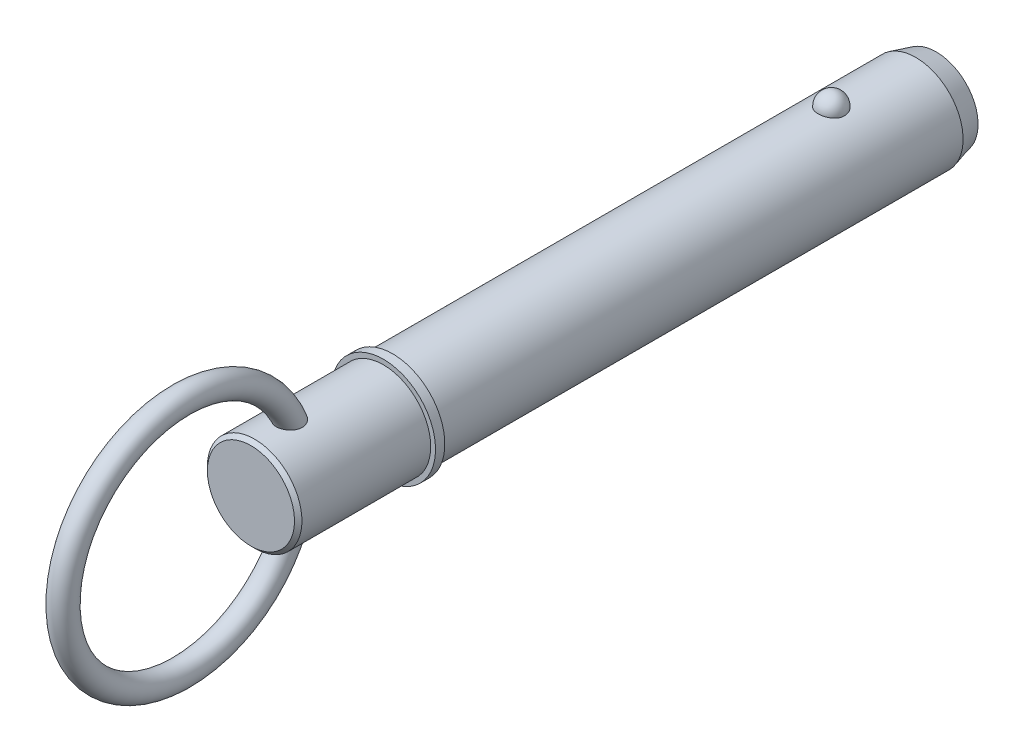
ISO-10303-21;
HEADER;
FILE_DESCRIPTION(('STEP AP214'),'2;1');
FILE_NAME('part.step','',(''),(''),'','','');
FILE_SCHEMA(('AUTOMOTIVE_DESIGN { 1 0 10303 214 1 1 1 1 }'));
ENDSEC;
DATA;
#1=APPLICATION_CONTEXT('core data for automotive mechanical design processes');
#2=APPLICATION_PROTOCOL_DEFINITION('international standard','automotive_design',2000,#1);
#3=PRODUCT_CONTEXT('',#1,'mechanical');
#4=PRODUCT('Part','Part','',(#3));
#5=PRODUCT_RELATED_PRODUCT_CATEGORY('part','',(#4));
#6=PRODUCT_DEFINITION_FORMATION('','',#4);
#7=PRODUCT_DEFINITION_CONTEXT('part definition',#1,'design');
#8=PRODUCT_DEFINITION('design','',#6,#7);
#9=PRODUCT_DEFINITION_SHAPE('','',#8);
#10=(LENGTH_UNIT() NAMED_UNIT(*) SI_UNIT(.MILLI.,.METRE.));
#11=(NAMED_UNIT(*) PLANE_ANGLE_UNIT() SI_UNIT($,.RADIAN.));
#12=(NAMED_UNIT(*) SI_UNIT($,.STERADIAN.) SOLID_ANGLE_UNIT());
#13=UNCERTAINTY_MEASURE_WITH_UNIT(LENGTH_MEASURE(1.E-05),#10,'distance_accuracy_value','');
#14=(GEOMETRIC_REPRESENTATION_CONTEXT(3) GLOBAL_UNCERTAINTY_ASSIGNED_CONTEXT((#13)) GLOBAL_UNIT_ASSIGNED_CONTEXT((#10,
#11,#12)) REPRESENTATION_CONTEXT('',''));
#15=CARTESIAN_POINT('',(0.,0.,0.));
#16=DIRECTION('',(0.,0.,1.));
#17=DIRECTION('',(1.,0.,0.));
#18=AXIS2_PLACEMENT_3D('',#15,#16,#17);
#19=CARTESIAN_POINT('',(0.,0.,114.3));
#20=DIRECTION('',(0.,0.,-1.));
#21=DIRECTION('',(-1.,0.,0.));
#22=AXIS2_PLACEMENT_3D('',#19,#20,#21);
#23=CYLINDRICAL_SURFACE('',#22,12.7);
#24=CARTESIAN_POINT('',(3.52486003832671,12.2010393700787,-3.56));
#25=CARTESIAN_POINT('',(3.52485671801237,12.2010422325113,-3.3610062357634));
#26=CARTESIAN_POINT('',(3.50863187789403,12.2057632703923,-3.16197042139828));
#27=CARTESIAN_POINT('',(3.4441205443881,12.2241207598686,-2.76953945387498));
#28=CARTESIAN_POINT('',(3.39582213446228,12.2377605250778,-2.57614642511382));
#29=CARTESIAN_POINT('',(3.26839193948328,12.2724057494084,-2.20059799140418));
#30=CARTESIAN_POINT('',(3.18927369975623,12.2934079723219,-2.01843769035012));
#31=CARTESIAN_POINT('',(3.00217139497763,12.3404306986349,-1.6703228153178));
#32=CARTESIAN_POINT('',(2.89418796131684,12.3664510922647,-1.50436788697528));
#33=CARTESIAN_POINT('',(2.65144862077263,12.4207616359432,-1.19241975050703));
#34=CARTESIAN_POINT('',(2.51656310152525,12.4490623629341,-1.04652919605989));
#35=CARTESIAN_POINT('',(2.22383249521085,12.5046678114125,-0.779711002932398));
#36=CARTESIAN_POINT('',(2.0659873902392,12.5319725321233,-0.658783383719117));
#37=CARTESIAN_POINT('',(1.73204520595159,12.5824645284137,-0.445586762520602));
#38=CARTESIAN_POINT('',(1.55600183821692,12.6056634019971,-0.353236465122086));
#39=CARTESIAN_POINT('',(1.19021695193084,12.6454411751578,-0.199381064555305));
#40=CARTESIAN_POINT('',(1.00047694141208,12.6620208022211,-0.137872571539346));
#41=CARTESIAN_POINT('',(0.616329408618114,12.6864692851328,-0.0483191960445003));
#42=CARTESIAN_POINT('',(0.422067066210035,12.6944893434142,-0.0196927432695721));
#43=CARTESIAN_POINT('',(0.0313259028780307,12.7014637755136,0.00524116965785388));
#44=CARTESIAN_POINT('',(-0.165152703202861,12.7004190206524,0.00155173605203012));
#45=CARTESIAN_POINT('',(-0.551780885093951,12.6894611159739,-0.0377454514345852));
#46=CARTESIAN_POINT('',(-0.74198078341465,12.6796749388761,-0.0728962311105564));
#47=CARTESIAN_POINT('',(-1.11361063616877,12.6524544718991,-0.173489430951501));
#48=CARTESIAN_POINT('',(-1.29504043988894,12.6350200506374,-0.238932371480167));
#49=CARTESIAN_POINT('',(-1.64521311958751,12.5942270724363,-0.398772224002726));
#50=CARTESIAN_POINT('',(-1.81387645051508,12.5708347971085,-0.493334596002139));
#51=CARTESIAN_POINT('',(-2.13292959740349,12.5206522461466,-0.708731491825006));
#52=CARTESIAN_POINT('',(-2.28331755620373,12.4938616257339,-0.829568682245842));
#53=CARTESIAN_POINT('',(-2.56470285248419,12.4391828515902,-1.0968714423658));
#54=CARTESIAN_POINT('',(-2.69527522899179,12.4112835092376,-1.24378221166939));
#55=CARTESIAN_POINT('',(-2.93023079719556,12.3579248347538,-1.55763192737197));
#56=CARTESIAN_POINT('',(-3.03461212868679,12.3324656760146,-1.72457229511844));
#57=CARTESIAN_POINT('',(-3.21564423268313,12.2865167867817,-2.07598316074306));
#58=CARTESIAN_POINT('',(-3.29196222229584,12.2660875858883,-2.26063321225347));
#59=CARTESIAN_POINT('',(-3.41323771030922,12.2328979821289,-2.64061334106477));
#60=CARTESIAN_POINT('',(-3.45819611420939,12.2201373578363,-2.83594310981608));
#61=CARTESIAN_POINT('',(-3.51550038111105,12.2037762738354,-3.2308649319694));
#62=CARTESIAN_POINT('',(-3.5279827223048,12.200137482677,-3.43043558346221));
#63=CARTESIAN_POINT('',(-3.52041430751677,12.2023234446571,-3.8289025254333));
#64=CARTESIAN_POINT('',(-3.50036443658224,12.2081479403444,-4.02779883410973));
#65=CARTESIAN_POINT('',(-3.42842010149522,12.2285446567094,-4.41824213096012));
#66=CARTESIAN_POINT('',(-3.37668525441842,12.243073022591,-4.6098208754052));
#67=CARTESIAN_POINT('',(-3.24279085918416,12.2792134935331,-4.98132360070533));
#68=CARTESIAN_POINT('',(-3.16063009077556,12.300825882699,-5.16124711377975));
#69=CARTESIAN_POINT('',(-2.96738224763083,12.3488691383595,-5.50542856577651));
#70=CARTESIAN_POINT('',(-2.85613997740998,12.3753256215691,-5.66959579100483));
#71=CARTESIAN_POINT('',(-2.60773241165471,12.4300386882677,-5.97665065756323));
#72=CARTESIAN_POINT('',(-2.47056612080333,12.458295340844,-6.11953748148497));
#73=CARTESIAN_POINT('',(-2.17327999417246,12.5135827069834,-6.38059312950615));
#74=CARTESIAN_POINT('',(-2.01307652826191,12.5406084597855,-6.49866785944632));
#75=CARTESIAN_POINT('',(-1.67442544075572,12.5902954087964,-6.70609314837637));
#76=CARTESIAN_POINT('',(-1.49597909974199,12.6129569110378,-6.79544572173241));
#77=CARTESIAN_POINT('',(-1.12819666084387,12.6511224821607,-6.94192787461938));
#78=CARTESIAN_POINT('',(-0.93902400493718,12.666712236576,-6.99944518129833));
#79=CARTESIAN_POINT('',(-0.553267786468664,12.6894125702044,-7.08227444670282));
#80=CARTESIAN_POINT('',(-0.356685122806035,12.6965241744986,-7.10759029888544));
#81=CARTESIAN_POINT('',(0.0343320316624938,12.7014305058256,-7.12510946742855));
#82=CARTESIAN_POINT('',(0.228736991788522,12.6993986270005,-7.11792901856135));
#83=CARTESIAN_POINT('',(0.613493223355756,12.6866339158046,-7.07206766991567));
#84=CARTESIAN_POINT('',(0.803844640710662,12.6759013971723,-7.03338790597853));
#85=CARTESIAN_POINT('',(1.17440741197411,12.6469443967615,-6.925834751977));
#86=CARTESIAN_POINT('',(1.35465462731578,12.6287486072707,-6.85707692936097));
#87=CARTESIAN_POINT('',(1.70092526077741,12.5867908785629,-6.69128257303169));
#88=CARTESIAN_POINT('',(1.86694777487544,12.5630285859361,-6.59424424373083));
#89=CARTESIAN_POINT('',(2.18289085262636,12.5120350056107,-6.3727748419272));
#90=CARTESIAN_POINT('',(2.33252391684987,12.4847559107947,-6.24794475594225));
#91=CARTESIAN_POINT('',(2.60889724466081,12.4299457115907,-5.97511730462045));
#92=CARTESIAN_POINT('',(2.73563353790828,12.4024145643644,-5.82711592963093));
#93=CARTESIAN_POINT('',(2.96505559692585,12.3495984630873,-5.5091226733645));
#94=CARTESIAN_POINT('',(3.06728335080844,12.3243610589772,-5.33879227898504));
#95=CARTESIAN_POINT('',(3.24218794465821,12.2795120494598,-4.98295005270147));
#96=CARTESIAN_POINT('',(3.31487538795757,12.2598984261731,-4.79744369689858));
#97=CARTESIAN_POINT('',(3.42255689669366,12.2302435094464,-4.43775244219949));
#98=CARTESIAN_POINT('',(3.46085292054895,12.2193780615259,-4.264615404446));
#99=CARTESIAN_POINT('',(3.5120056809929,12.2047747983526,-3.9143299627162));
#100=CARTESIAN_POINT('',(3.52486299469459,12.2010368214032,-3.73718164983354));
#101=CARTESIAN_POINT('',(3.52486003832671,12.2010393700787,-3.56));
#102=B_SPLINE_CURVE_WITH_KNOTS('',3,(#24,#25,#26,#27,#28,#29,#30,#31,#32,#33,#34,#35,#36,#37,
#38,#39,#40,#41,#42,#43,#44,#45,#46,#47,#48,#49,#50,#51,#52,#53,#54,#55,#56,#57,#58,#59,#60,#61,
#62,#63,#64,#65,#66,#67,#68,#69,#70,#71,#72,#73,#74,#75,#76,#77,#78,#79,#80,#81,#82,#83,#84,#85,
#86,#87,#88,#89,#90,#91,#92,#93,#94,#95,#96,#97,#98,#99,#100,#101),.UNSPECIFIED.,.T.,.F.,(4,2,2,
2,2,2,2,2,2,2,2,2,2,2,2,2,2,2,2,2,2,2,2,2,2,2,2,2,2,2,2,2,2,2,2,2,2,2,4),(0.,0.596344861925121,
1.19291141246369,1.78921606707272,2.38550767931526,2.98474477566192,3.58398233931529,
4.18149920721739,4.77895038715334,5.36566361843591,5.95232045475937,6.53059198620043,
7.10887345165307,7.6905033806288,8.27219236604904,8.86498552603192,9.45782077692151,
10.0574751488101,10.6571122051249,11.2542252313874,11.8513220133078,12.4454353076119,
13.0395724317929,13.636947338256,14.2343451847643,14.8339691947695,15.4335511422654,
16.0256602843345,16.6176978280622,17.1985559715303,17.7793931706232,18.3580179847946,
18.9366795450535,19.5242567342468,20.1119357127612,20.7098642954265,21.3075780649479,
21.8385683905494,22.3695466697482),.UNSPECIFIED.);
#103=CARTESIAN_POINT('',(3.52486003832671,12.2010393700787,-3.56));
#104=VERTEX_POINT('',#103);
#105=EDGE_CURVE('E101',#104,#104,#102,.T.);
#106=ORIENTED_EDGE('',*,*,#105,.T.);
#107=EDGE_LOOP('',(#106));
#108=FACE_BOUND('',#107,.T.);
#109=CARTESIAN_POINT('',(0.,0.,-26.2499999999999));
#110=DIRECTION('',(0.,0.,-1.));
#111=DIRECTION('',(-1.,0.,0.));
#112=AXIS2_PLACEMENT_3D('',#109,#110,#111);
#113=CIRCLE('',#112,12.7);
#114=CARTESIAN_POINT('',(-12.7,0.,-26.2499999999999));
#115=VERTEX_POINT('',#114);
#116=EDGE_CURVE('E109',#115,#115,#113,.F.);
#117=ORIENTED_EDGE('',*,*,#116,.T.);
#118=EDGE_LOOP('',(#117));
#119=FACE_BOUND('',#118,.T.);
#120=CARTESIAN_POINT('',(0.,0.,114.3));
#121=DIRECTION('',(0.,0.,1.));
#122=DIRECTION('',(1.,0.,0.));
#123=AXIS2_PLACEMENT_3D('',#120,#121,#122);
#124=CIRCLE('',#123,12.7);
#125=CARTESIAN_POINT('',(12.7,0.,114.3));
#126=VERTEX_POINT('',#125);
#127=EDGE_CURVE('E107',#126,#126,#124,.T.);
#128=ORIENTED_EDGE('',*,*,#127,.F.);
#129=EDGE_LOOP('',(#128));
#130=FACE_BOUND('',#129,.T.);
#131=ADVANCED_FACE('F39',(#108,#119,#130),#23,.T.);
#132=CARTESIAN_POINT('',(0.,0.,-31.75));
#133=DIRECTION('',(0.,0.,-1.));
#134=DIRECTION('',(-1.,0.,0.));
#135=AXIS2_PLACEMENT_3D('',#132,#133,#134);
#136=PLANE('',#135);
#137=CARTESIAN_POINT('',(0.,0.,-31.75));
#138=DIRECTION('',(0.,0.,-1.));
#139=DIRECTION('',(-1.,0.,0.));
#140=AXIS2_PLACEMENT_3D('',#137,#138,#139);
#141=CIRCLE('',#140,11.2262794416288);
#142=CARTESIAN_POINT('',(-11.2262794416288,0.,-31.75));
#143=VERTEX_POINT('',#142);
#144=EDGE_CURVE('E142',#143,#143,#141,.T.);
#145=ORIENTED_EDGE('',*,*,#144,.T.);
#146=EDGE_LOOP('',(#145));
#147=FACE_BOUND('',#146,.T.);
#148=ADVANCED_FACE('F87',(#147),#136,.T.);
#149=CARTESIAN_POINT('',(0.,0.,-31.75));
#150=DIRECTION('',(0.,0.,1.));
#151=DIRECTION('',(1.,0.,0.));
#152=AXIS2_PLACEMENT_3D('',#149,#150,#151);
#153=CONICAL_SURFACE('',#152,11.2262794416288,0.261799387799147);
#154=ORIENTED_EDGE('',*,*,#116,.F.);
#155=EDGE_LOOP('',(#154));
#156=FACE_BOUND('',#155,.T.);
#157=ORIENTED_EDGE('',*,*,#144,.F.);
#158=EDGE_LOOP('',(#157));
#159=FACE_BOUND('',#158,.T.);
#160=ADVANCED_FACE('F93',(#156,#159),#153,.T.);
#161=CARTESIAN_POINT('',(0.,12.7,-3.56));
#162=DIRECTION('',(0.,1.,0.));
#163=DIRECTION('',(0.,0.,1.));
#164=AXIS2_PLACEMENT_3D('',#161,#162,#163);
#165=SPHERICAL_SURFACE('',#164,3.56);
#166=ORIENTED_EDGE('',*,*,#105,.F.);
#167=EDGE_LOOP('',(#166));
#168=FACE_BOUND('',#167,.T.);
#169=ADVANCED_FACE('F112',(#168),#165,.T.);
#170=CARTESIAN_POINT('',(0.,0.,114.3));
#171=DIRECTION('',(0.,0.,-1.));
#172=DIRECTION('',(-1.,0.,0.));
#173=AXIS2_PLACEMENT_3D('',#170,#171,#172);
#174=PLANE('',#173);
#175=ORIENTED_EDGE('',*,*,#127,.T.);
#176=EDGE_LOOP('',(#175));
#177=FACE_BOUND('',#176,.T.);
#178=CARTESIAN_POINT('',(0.,0.,114.3));
#179=DIRECTION('',(0.,0.,-1.));
#180=DIRECTION('',(-1.,0.,0.));
#181=AXIS2_PLACEMENT_3D('',#178,#179,#180);
#182=CIRCLE('',#181,14.);
#183=CARTESIAN_POINT('',(-14.,0.,114.3));
#184=VERTEX_POINT('',#183);
#185=EDGE_CURVE('E108',#184,#184,#182,.T.);
#186=ORIENTED_EDGE('',*,*,#185,.T.);
#187=EDGE_LOOP('',(#186));
#188=FACE_BOUND('',#187,.T.);
#189=ADVANCED_FACE('F116',(#177,#188),#174,.T.);
#190=CARTESIAN_POINT('',(0.,0.,33.7287874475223));
#191=DIRECTION('',(0.,0.,-1.));
#192=DIRECTION('',(-1.,0.,0.));
#193=AXIS2_PLACEMENT_3D('',#190,#191,#192);
#194=CYLINDRICAL_SURFACE('',#193,14.);
#195=CARTESIAN_POINT('',(0.,0.,116.8));
#196=DIRECTION('',(0.,0.,-1.));
#197=DIRECTION('',(-1.,0.,0.));
#198=AXIS2_PLACEMENT_3D('',#195,#196,#197);
#199=CIRCLE('',#198,14.);
#200=CARTESIAN_POINT('',(-14.,0.,116.8));
#201=VERTEX_POINT('',#200);
#202=EDGE_CURVE('E133',#201,#201,#199,.T.);
#203=ORIENTED_EDGE('',*,*,#202,.T.);
#204=EDGE_LOOP('',(#203));
#205=FACE_BOUND('',#204,.T.);
#206=ORIENTED_EDGE('',*,*,#185,.F.);
#207=EDGE_LOOP('',(#206));
#208=FACE_BOUND('',#207,.T.);
#209=ADVANCED_FACE('F120',(#205,#208),#194,.T.);
#210=CARTESIAN_POINT('',(0.,14.,116.8));
#211=DIRECTION('',(0.,0.,1.));
#212=DIRECTION('',(1.,0.,0.));
#213=AXIS2_PLACEMENT_3D('',#210,#211,#212);
#214=PLANE('',#213);
#215=CARTESIAN_POINT('',(0.,0.,116.8));
#216=DIRECTION('',(0.,0.,1.));
#217=DIRECTION('',(1.,0.,0.));
#218=AXIS2_PLACEMENT_3D('',#215,#216,#217);
#219=CIRCLE('',#218,12.7);
#220=CARTESIAN_POINT('',(12.7,0.,116.8));
#221=VERTEX_POINT('',#220);
#222=EDGE_CURVE('E111',#221,#221,#219,.T.);
#223=ORIENTED_EDGE('',*,*,#222,.F.);
#224=EDGE_LOOP('',(#223));
#225=FACE_BOUND('',#224,.T.);
#226=ORIENTED_EDGE('',*,*,#202,.F.);
#227=EDGE_LOOP('',(#226));
#228=FACE_BOUND('',#227,.T.);
#229=ADVANCED_FACE('F84',(#225,#228),#214,.T.);
#230=CARTESIAN_POINT('',(0.,0.,152.4));
#231=DIRECTION('',(0.,0.,-1.));
#232=DIRECTION('',(-1.,0.,0.));
#233=AXIS2_PLACEMENT_3D('',#230,#231,#232);
#234=CYLINDRICAL_SURFACE('',#233,12.7);
#235=CARTESIAN_POINT('',(-1.22892607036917,-12.6404011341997,138.77119395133));
#236=CARTESIAN_POINT('',(-1.06119922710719,-12.6567092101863,138.704004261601));
#237=CARTESIAN_POINT('',(-0.887663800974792,-12.6701810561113,138.650792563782));
#238=CARTESIAN_POINT('',(-0.533823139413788,-12.6900116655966,138.573419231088));
#239=CARTESIAN_POINT('',(-0.353518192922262,-12.6963707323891,138.5492563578));
#240=CARTESIAN_POINT('',(0.00871153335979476,-12.7012887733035,138.530519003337));
#241=CARTESIAN_POINT('',(0.190636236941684,-12.699848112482,138.535943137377));
#242=CARTESIAN_POINT('',(0.550971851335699,-12.6893231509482,138.576255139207));
#243=CARTESIAN_POINT('',(0.729382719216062,-12.6802387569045,138.61114336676));
#244=CARTESIAN_POINT('',(1.0777168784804,-12.6553960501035,138.709659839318));
#245=CARTESIAN_POINT('',(1.24763507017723,-12.6396337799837,138.773305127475));
#246=CARTESIAN_POINT('',(1.57398922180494,-12.6031560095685,138.927891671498));
#247=CARTESIAN_POINT('',(1.73042571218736,-12.5824407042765,139.018831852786));
#248=CARTESIAN_POINT('',(2.02464767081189,-12.5384554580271,139.225320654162));
#249=CARTESIAN_POINT('',(2.16251370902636,-12.5151974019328,139.34075697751));
#250=CARTESIAN_POINT('',(2.41652917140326,-12.4686447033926,139.593426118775));
#251=CARTESIAN_POINT('',(2.53268123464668,-12.4453500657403,139.730656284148));
#252=CARTESIAN_POINT('',(2.7397169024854,-12.4014166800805,140.02226178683));
#253=CARTESIAN_POINT('',(2.83072997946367,-12.3807646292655,140.176543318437));
#254=CARTESIAN_POINT('',(2.98642630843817,-12.3441356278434,140.498338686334));
#255=CARTESIAN_POINT('',(3.05110876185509,-12.3281588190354,140.665852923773));
#256=CARTESIAN_POINT('',(3.15450336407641,-12.3021148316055,141.012705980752));
#257=CARTESIAN_POINT('',(3.19268116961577,-12.2921697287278,141.192212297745));
#258=CARTESIAN_POINT('',(3.24150148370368,-12.2793848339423,141.555144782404));
#259=CARTESIAN_POINT('',(3.25213515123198,-12.2765473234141,141.738572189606));
#260=CARTESIAN_POINT('',(3.24696781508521,-12.2779158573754,142.118893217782));
#261=CARTESIAN_POINT('',(3.22910261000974,-12.2826719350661,142.315753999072));
#262=CARTESIAN_POINT('',(3.1650495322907,-12.2993299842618,142.70447917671));
#263=CARTESIAN_POINT('',(3.11884966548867,-12.3112349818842,142.896341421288));
#264=CARTESIAN_POINT('',(2.99323123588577,-12.3424162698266,143.292891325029));
#265=CARTESIAN_POINT('',(2.91059577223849,-12.3623844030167,143.496505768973));
#266=CARTESIAN_POINT('',(2.71447440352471,-12.4069229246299,143.888190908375));
#267=CARTESIAN_POINT('',(2.60094970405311,-12.431499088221,144.076241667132));
#268=CARTESIAN_POINT('',(2.40499526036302,-12.4703951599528,144.347470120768));
#269=CARTESIAN_POINT('',(2.33301847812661,-12.4841083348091,144.438407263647));
#270=CARTESIAN_POINT('',(2.18106597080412,-12.5115521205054,144.613320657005));
#271=CARTESIAN_POINT('',(2.10108885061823,-12.5252827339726,144.697295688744));
#272=CARTESIAN_POINT('',(1.84973962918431,-12.5657115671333,144.936779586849));
#273=CARTESIAN_POINT('',(1.6664677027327,-12.5917488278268,145.080526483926));
#274=CARTESIAN_POINT('',(1.33551340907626,-12.6303067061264,145.285856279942));
#275=CARTESIAN_POINT('',(1.19512135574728,-12.6444898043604,145.35902243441));
#276=CARTESIAN_POINT('',(0.903945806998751,-12.6686276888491,145.481586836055));
#277=CARTESIAN_POINT('',(0.753173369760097,-12.6785868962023,145.531009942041));
#278=CARTESIAN_POINT('',(0.444090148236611,-12.6931800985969,145.602942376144));
#279=CARTESIAN_POINT('',(0.285741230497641,-12.6977833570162,145.625296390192));
#280=CARTESIAN_POINT('',(-0.0324491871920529,-12.700953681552,145.640724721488));
#281=CARTESIAN_POINT('',(-0.192290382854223,-12.6995219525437,145.633804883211));
#282=CARTESIAN_POINT('',(-0.493822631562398,-12.6912132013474,145.593209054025));
#283=CARTESIAN_POINT('',(-0.635865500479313,-12.6848307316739,145.561962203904));
#284=CARTESIAN_POINT('',(-0.913041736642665,-12.6678986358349,145.477721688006));
#285=CARTESIAN_POINT('',(-1.04817349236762,-12.6573480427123,145.424722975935));
#286=CARTESIAN_POINT('',(-1.31637898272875,-12.6323524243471,145.296233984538));
#287=CARTESIAN_POINT('',(-1.44890088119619,-12.6177203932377,145.219638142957));
#288=CARTESIAN_POINT('',(-1.70162176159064,-12.5861326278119,145.048743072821));
#289=CARTESIAN_POINT('',(-1.82181486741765,-12.569175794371,144.954435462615));
#290=CARTESIAN_POINT('',(-2.06961284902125,-12.5309682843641,144.732665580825));
#291=CARTESIAN_POINT('',(-2.1945762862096,-12.5094982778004,144.60229330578));
#292=CARTESIAN_POINT('',(-2.4250376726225,-12.4668738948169,144.325308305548));
#293=CARTESIAN_POINT('',(-2.53052086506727,-12.4457197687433,144.178683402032));
#294=CARTESIAN_POINT('',(-2.73961150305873,-12.4015349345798,143.843065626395));
#295=CARTESIAN_POINT('',(-2.83895917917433,-12.3789253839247,143.651346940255));
#296=CARTESIAN_POINT('',(-3.00725804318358,-12.3391195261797,143.254405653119));
#297=CARTESIAN_POINT('',(-3.07618857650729,-12.3219268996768,143.049173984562));
#298=CARTESIAN_POINT('',(-3.18528660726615,-12.2942052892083,142.613754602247));
#299=CARTESIAN_POINT('',(-3.22287145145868,-12.2842816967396,142.382855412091));
#300=CARTESIAN_POINT('',(-3.24821271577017,-12.2775854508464,142.034351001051));
#301=CARTESIAN_POINT('',(-3.25148236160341,-12.276719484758,141.917777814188));
#302=CARTESIAN_POINT('',(-3.24729041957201,-12.2778310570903,141.684859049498));
#303=CARTESIAN_POINT('',(-3.23983534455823,-12.2798068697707,141.568513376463));
#304=CARTESIAN_POINT('',(-3.21488959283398,-12.286359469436,141.34622762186));
#305=CARTESIAN_POINT('',(-3.19823165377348,-12.2907201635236,141.240186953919));
#306=CARTESIAN_POINT('',(-3.15537465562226,-12.3017926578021,141.03022257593));
#307=CARTESIAN_POINT('',(-3.12918076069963,-12.3085031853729,140.926297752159));
#308=CARTESIAN_POINT('',(-3.06721568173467,-12.3240904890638,140.721553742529));
#309=CARTESIAN_POINT('',(-3.03144854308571,-12.3329663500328,140.620733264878));
#310=CARTESIAN_POINT('',(-2.95042598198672,-12.3525998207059,140.423171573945));
#311=CARTESIAN_POINT('',(-2.90517160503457,-12.3633572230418,140.326429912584));
#312=CARTESIAN_POINT('',(-2.81116315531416,-12.3850478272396,140.148857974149));
#313=CARTESIAN_POINT('',(-2.76340897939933,-12.3958187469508,140.067476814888));
#314=CARTESIAN_POINT('',(-2.66091958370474,-12.4182228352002,139.909317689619));
#315=CARTESIAN_POINT('',(-2.60618212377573,-12.4298562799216,139.832541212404));
#316=CARTESIAN_POINT('',(-2.49013138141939,-12.4536239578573,139.684278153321));
#317=CARTESIAN_POINT('',(-2.42882150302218,-12.4657579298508,139.612788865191));
#318=CARTESIAN_POINT('',(-2.30002146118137,-12.4901640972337,139.475587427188));
#319=CARTESIAN_POINT('',(-2.23252894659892,-12.5024363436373,139.409877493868));
#320=CARTESIAN_POINT('',(-2.09370795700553,-12.5264205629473,139.286377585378));
#321=CARTESIAN_POINT('',(-2.02252382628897,-12.5381388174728,139.228426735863));
#322=CARTESIAN_POINT('',(-1.87531735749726,-12.5610012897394,139.11889123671));
#323=CARTESIAN_POINT('',(-1.79929316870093,-12.5721452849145,139.067309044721));
#324=CARTESIAN_POINT('',(-1.5648528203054,-12.6042047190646,138.922706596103));
#325=CARTESIAN_POINT('',(-1.39990754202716,-12.6237766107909,138.839687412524));
#326=CARTESIAN_POINT('',(-1.22892607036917,-12.6404011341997,138.77119395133));
#327=B_SPLINE_CURVE_WITH_KNOTS('',3,(#235,#236,#237,#238,#239,#240,#241,#242,#243,#244,#245,
#246,#247,#248,#249,#250,#251,#252,#253,#254,#255,#256,#257,#258,#259,#260,#261,#262,#263,#264,
#265,#266,#267,#268,#269,#270,#271,#272,#273,#274,#275,#276,#277,#278,#279,#280,#281,#282,#283,
#284,#285,#286,#287,#288,#289,#290,#291,#292,#293,#294,#295,#296,#297,#298,#299,#300,#301,#302,
#303,#304,#305,#306,#307,#308,#309,#310,#311,#312,#313,#314,#315,#316,#317,#318,#319,#320,#321,
#322,#323,#324,#325,#326),.UNSPECIFIED.,.T.,.F.,(4,2,2,2,2,2,2,2,2,2,2,2,2,2,2,2,2,2,2,2,2,2,2,
2,2,2,2,2,2,2,2,2,2,2,2,2,2,2,2,2,2,2,2,2,2,4),(0.,0.543509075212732,1.08699497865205,
1.63045544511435,2.17392254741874,2.71771216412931,3.26148037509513,3.80280767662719,
4.34406914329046,4.88248866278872,5.42092451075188,5.9699227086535,6.51909710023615,
7.10988630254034,7.70092576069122,8.3601374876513,9.02018098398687,9.3700914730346,
9.72006308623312,10.4175255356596,10.8925536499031,11.3670833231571,11.844322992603,
12.3214673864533,12.7562647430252,13.1911630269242,13.6507378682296,14.110530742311,
14.6541210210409,15.1981214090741,15.8467121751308,16.4957426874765,17.1940750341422,
17.5435132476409,17.8927393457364,18.2145822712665,18.536251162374,18.8577843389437,
19.1792821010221,19.463832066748,19.7484735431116,20.0329683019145,20.3175717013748,
20.5948148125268,20.8721645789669,21.4262200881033),.UNSPECIFIED.);
#328=CARTESIAN_POINT('',(-1.22892607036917,-12.6404011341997,138.77119395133));
#329=VERTEX_POINT('',#328);
#330=EDGE_CURVE('E10',#329,#329,#327,.T.);
#331=ORIENTED_EDGE('',*,*,#330,.F.);
#332=EDGE_LOOP('',(#331));
#333=FACE_BOUND('',#332,.T.);
#334=CARTESIAN_POINT('',(-1.22892607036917,12.6404011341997,138.77119395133));
#335=CARTESIAN_POINT('',(-1.39512541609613,12.624240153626,138.83776712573));
#336=CARTESIAN_POINT('',(-1.55582432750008,12.6052778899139,138.918153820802));
#337=CARTESIAN_POINT('',(-1.86136954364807,12.5638060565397,139.104658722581));
#338=CARTESIAN_POINT('',(-2.00617769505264,12.5412882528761,139.210836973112));
#339=CARTESIAN_POINT('',(-2.27547906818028,12.4952333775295,139.446103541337));
#340=CARTESIAN_POINT('',(-2.39998742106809,12.4716970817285,139.575174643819));
#341=CARTESIAN_POINT('',(-2.62534229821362,12.4262157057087,139.852623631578));
#342=CARTESIAN_POINT('',(-2.72620384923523,12.4042696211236,140.000989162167));
#343=CARTESIAN_POINT('',(-2.90197976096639,12.3643304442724,140.3126750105));
#344=CARTESIAN_POINT('',(-2.97691335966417,12.346334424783,140.475984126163));
#345=CARTESIAN_POINT('',(-3.09983588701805,12.3160482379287,140.812927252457));
#346=CARTESIAN_POINT('',(-3.14781852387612,12.3037594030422,140.986563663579));
#347=CARTESIAN_POINT('',(-3.21809353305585,12.2855709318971,141.345523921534));
#348=CARTESIAN_POINT('',(-3.23943500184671,12.2799082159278,141.531044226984));
#349=CARTESIAN_POINT('',(-3.2544382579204,12.2759385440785,141.903232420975));
#350=CARTESIAN_POINT('',(-3.24809142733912,12.2776338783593,142.089900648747));
#351=CARTESIAN_POINT('',(-3.20755159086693,12.288291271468,142.477577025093));
#352=CARTESIAN_POINT('',(-3.17081691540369,12.2979162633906,142.678299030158));
#353=CARTESIAN_POINT('',(-3.06845850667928,12.3238513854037,143.071858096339));
#354=CARTESIAN_POINT('',(-3.00281105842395,12.3401670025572,143.264688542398));
#355=CARTESIAN_POINT('',(-2.83560995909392,12.3797223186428,143.659473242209));
#356=CARTESIAN_POINT('',(-2.73085133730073,12.4035339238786,143.860019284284));
#357=CARTESIAN_POINT('',(-2.48976141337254,12.4541651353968,144.240813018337));
#358=CARTESIAN_POINT('',(-2.35343772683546,12.4809840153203,144.421065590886));
#359=CARTESIAN_POINT('',(-2.0768398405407,12.5296806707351,144.72565995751));
#360=CARTESIAN_POINT('',(-1.94129351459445,12.551613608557,144.854283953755));
#361=CARTESIAN_POINT('',(-1.65081707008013,12.5931023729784,145.087836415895));
#362=CARTESIAN_POINT('',(-1.49591505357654,12.6126615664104,145.192798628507));
#363=CARTESIAN_POINT('',(-1.19690065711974,12.6442092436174,145.357788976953));
#364=CARTESIAN_POINT('',(-1.05541267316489,12.6569190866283,145.422418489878));
#365=CARTESIAN_POINT('',(-0.763415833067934,12.6778764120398,145.527638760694));
#366=CARTESIAN_POINT('',(-0.612913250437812,12.6861269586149,145.568246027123));
#367=CARTESIAN_POINT('',(-0.306168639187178,12.697239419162,145.622715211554));
#368=CARTESIAN_POINT('',(-0.149903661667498,12.7000767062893,145.636454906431));
#369=CARTESIAN_POINT('',(0.16255262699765,12.699920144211,145.63569423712));
#370=CARTESIAN_POINT('',(0.318743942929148,12.6969267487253,145.621196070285));
#371=CARTESIAN_POINT('',(0.614555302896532,12.6859231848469,145.567234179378));
#372=CARTESIAN_POINT('',(0.754548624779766,12.6782987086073,145.529687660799));
#373=CARTESIAN_POINT('',(1.0268504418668,12.6591561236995,145.433711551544));
#374=CARTESIAN_POINT('',(1.15915690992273,12.6476369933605,145.375276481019));
#375=CARTESIAN_POINT('',(1.42405861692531,12.6206654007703,145.234988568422));
#376=CARTESIAN_POINT('',(1.5558287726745,12.604971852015,145.151635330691));
#377=CARTESIAN_POINT('',(1.80621935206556,12.571537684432,144.967498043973));
#378=CARTESIAN_POINT('',(1.92483289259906,12.5537960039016,144.866704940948));
#379=CARTESIAN_POINT('',(2.16936918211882,12.5140714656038,144.630174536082));
#380=CARTESIAN_POINT('',(2.29236422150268,12.4919255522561,144.491439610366));
#381=CARTESIAN_POINT('',(2.5176248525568,12.4484835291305,144.197913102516));
#382=CARTESIAN_POINT('',(2.61987416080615,12.4271880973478,144.043109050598));
#383=CARTESIAN_POINT('',(2.81956306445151,12.3835520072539,143.691316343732));
#384=CARTESIAN_POINT('',(2.91268031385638,12.3617361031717,143.491798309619));
#385=CARTESIAN_POINT('',(3.06675738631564,12.3244204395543,143.079898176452));
#386=CARTESIAN_POINT('',(3.12769905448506,12.3089242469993,142.867508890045));
#387=CARTESIAN_POINT('',(3.19410612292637,12.2917937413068,142.537729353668));
#388=CARTESIAN_POINT('',(3.21217746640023,12.2870696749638,142.422917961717));
#389=CARTESIAN_POINT('',(3.23822570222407,12.2802317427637,142.192095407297));
#390=CARTESIAN_POINT('',(3.24620727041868,12.2781166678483,142.07608482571));
#391=CARTESIAN_POINT('',(3.25166839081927,12.2766712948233,141.84381042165));
#392=CARTESIAN_POINT('',(3.24914931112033,12.2773406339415,141.727546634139));
#393=CARTESIAN_POINT('',(3.23325304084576,12.2815367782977,141.495869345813));
#394=CARTESIAN_POINT('',(3.2198826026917,12.2850618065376,141.38045536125));
#395=CARTESIAN_POINT('',(3.18378347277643,12.2944635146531,141.162188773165));
#396=CARTESIAN_POINT('',(3.16203615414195,12.3000921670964,141.059162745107));
#397=CARTESIAN_POINT('',(3.10931056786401,12.3135262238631,140.855694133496));
#398=CARTESIAN_POINT('',(3.07833729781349,12.3213304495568,140.75525018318));
#399=CARTESIAN_POINT('',(3.00719503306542,12.3388864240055,140.557882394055));
#400=CARTESIAN_POINT('',(2.9670290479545,12.34863753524,140.460957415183));
#401=CARTESIAN_POINT('',(2.87766260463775,12.3697681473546,140.27155308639));
#402=CARTESIAN_POINT('',(2.82846300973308,12.3811474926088,140.179073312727));
#403=CARTESIAN_POINT('',(2.72718770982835,12.4038233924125,140.009278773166));
#404=CARTESIAN_POINT('',(2.67601025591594,12.4149937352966,139.931409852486));
#405=CARTESIAN_POINT('',(2.56702778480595,12.4379850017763,139.780514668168));
#406=CARTESIAN_POINT('',(2.5092205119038,12.4498061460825,139.707490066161));
#407=CARTESIAN_POINT('',(2.38741431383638,12.4737362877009,139.566915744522));
#408=CARTESIAN_POINT('',(2.32341881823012,12.4858451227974,139.499363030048));
#409=CARTESIAN_POINT('',(2.18967865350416,12.5099935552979,139.370183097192));
#410=CARTESIAN_POINT('',(2.11993188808,12.5220331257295,139.308558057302));
#411=CARTESIAN_POINT('',(1.90863625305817,12.5565453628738,139.137971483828));
#412=CARTESIAN_POINT('',(1.75996750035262,12.5784460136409,139.037508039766));
#413=CARTESIAN_POINT('',(1.44761854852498,12.6182083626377,138.862748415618));
#414=CARTESIAN_POINT('',(1.28394037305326,12.6360706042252,138.788448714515));
#415=CARTESIAN_POINT('',(0.945887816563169,12.6658634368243,138.667537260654));
#416=CARTESIAN_POINT('',(0.771499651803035,12.6777861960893,138.620962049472));
#417=CARTESIAN_POINT('',(0.417041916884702,12.694390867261,138.556673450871));
#418=CARTESIAN_POINT('',(0.23696907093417,12.6990685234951,138.538977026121));
#419=CARTESIAN_POINT('',(-0.124879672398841,12.7006841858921,138.532829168));
#420=CARTESIAN_POINT('',(-0.306658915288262,12.6975703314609,138.544573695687));
#421=CARTESIAN_POINT('',(-0.66529779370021,12.6838264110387,138.597473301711));
#422=CARTESIAN_POINT('',(-0.842168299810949,12.6732146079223,138.638556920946));
#423=CARTESIAN_POINT('',(-1.05025519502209,12.6565519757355,138.705394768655));
#424=CARTESIAN_POINT('',(-1.08632235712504,12.6535053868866,138.717681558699));
#425=CARTESIAN_POINT('',(-1.15798463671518,12.6471484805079,138.743501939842));
#426=CARTESIAN_POINT('',(-1.19357974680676,12.643838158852,138.75703555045));
#427=CARTESIAN_POINT('',(-1.22892607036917,12.6404011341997,138.77119395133));
#428=B_SPLINE_CURVE_WITH_KNOTS('',3,(#334,#335,#336,#337,#338,#339,#340,#341,#342,#343,#344,
#345,#346,#347,#348,#349,#350,#351,#352,#353,#354,#355,#356,#357,#358,#359,#360,#361,#362,#363,
#364,#365,#366,#367,#368,#369,#370,#371,#372,#373,#374,#375,#376,#377,#378,#379,#380,#381,#382,
#383,#384,#385,#386,#387,#388,#389,#390,#391,#392,#393,#394,#395,#396,#397,#398,#399,#400,#401,
#402,#403,#404,#405,#406,#407,#408,#409,#410,#411,#412,#413,#414,#415,#416,#417,#418,#419,#420,
#421,#422,#423,#424,#425,#426,#427),.UNSPECIFIED.,.T.,.F.,(4,2,2,2,2,2,2,2,2,2,2,2,2,2,2,2,2,2,
2,2,2,2,2,2,2,2,2,2,2,2,2,2,2,2,2,2,2,2,2,2,2,2,2,2,2,2,4),(0.,0.539146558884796,
1.07956050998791,1.61956978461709,2.15923496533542,2.69849886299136,3.23788860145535,
3.79602631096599,4.3543377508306,4.96471598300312,5.57559579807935,6.25509482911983,
6.93443009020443,7.49671429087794,8.05819140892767,8.52445959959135,8.99040698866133,
9.45846913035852,9.92649485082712,10.3600530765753,10.7937251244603,11.2621204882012,
11.7307597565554,12.2888675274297,12.8474116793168,13.5084064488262,14.1697737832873,
14.5183408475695,14.8667463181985,15.2151063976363,15.5632498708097,15.8791508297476,
16.1948809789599,16.5105079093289,16.826104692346,17.1072964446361,17.3885841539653,
17.669716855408,17.9509524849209,18.490448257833,19.0298713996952,19.5700039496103,
20.1104536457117,20.6545101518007,21.1972460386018,21.3119068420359,21.4265694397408),.UNSPECIFIED.);
#429=CARTESIAN_POINT('',(-1.22892607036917,12.6404011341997,138.77119395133));
#430=VERTEX_POINT('',#429);
#431=EDGE_CURVE('E51',#430,#430,#428,.T.);
#432=ORIENTED_EDGE('',*,*,#431,.F.);
#433=EDGE_LOOP('',(#432));
#434=FACE_BOUND('',#433,.T.);
#435=CARTESIAN_POINT('',(0.,0.,151.4));
#436=DIRECTION('',(0.,0.,-1.));
#437=DIRECTION('',(-1.,0.,0.));
#438=AXIS2_PLACEMENT_3D('',#435,#436,#437);
#439=CIRCLE('',#438,12.7);
#440=CARTESIAN_POINT('',(-12.7,0.,151.4));
#441=VERTEX_POINT('',#440);
#442=EDGE_CURVE('E63',#441,#441,#439,.T.);
#443=ORIENTED_EDGE('',*,*,#442,.T.);
#444=EDGE_LOOP('',(#443));
#445=FACE_BOUND('',#444,.T.);
#446=ORIENTED_EDGE('',*,*,#222,.T.);
#447=EDGE_LOOP('',(#446));
#448=FACE_BOUND('',#447,.T.);
#449=ADVANCED_FACE('F68',(#333,#434,#445,#448),#234,.T.);
#450=CARTESIAN_POINT('',(0.,0.,152.4));
#451=DIRECTION('',(0.,0.,-1.));
#452=DIRECTION('',(-1.,0.,0.));
#453=AXIS2_PLACEMENT_3D('',#450,#451,#452);
#454=PLANE('',#453);
#455=CARTESIAN_POINT('',(0.,0.,152.4));
#456=DIRECTION('',(0.,0.,-1.));
#457=DIRECTION('',(-1.,0.,0.));
#458=AXIS2_PLACEMENT_3D('',#455,#456,#457);
#459=CIRCLE('',#458,11.6999999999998);
#460=CARTESIAN_POINT('',(-11.6999999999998,0.,152.4));
#461=VERTEX_POINT('',#460);
#462=EDGE_CURVE('E58',#461,#461,#459,.F.);
#463=ORIENTED_EDGE('',*,*,#462,.T.);
#464=EDGE_LOOP('',(#463));
#465=FACE_BOUND('',#464,.T.);
#466=ADVANCED_FACE('F75',(#465),#454,.F.);
#467=CARTESIAN_POINT('',(0.,0.,151.4));
#468=DIRECTION('',(0.,0.,-1.));
#469=DIRECTION('',(-1.,0.,0.));
#470=AXIS2_PLACEMENT_3D('',#467,#468,#469);
#471=CONICAL_SURFACE('',#470,12.7,0.785398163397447);
#472=ORIENTED_EDGE('',*,*,#462,.F.);
#473=EDGE_LOOP('',(#472));
#474=FACE_BOUND('',#473,.T.);
#475=ORIENTED_EDGE('',*,*,#442,.F.);
#476=EDGE_LOOP('',(#475));
#477=FACE_BOUND('',#476,.T.);
#478=ADVANCED_FACE('F41',(#474,#477),#471,.T.);
#479=CARTESIAN_POINT('',(0.,0.,171.15));
#480=DIRECTION('',(1.,0.,0.));
#481=DIRECTION('',(0.,0.,-1.));
#482=AXIS2_PLACEMENT_3D('',#479,#480,#481);
#483=TOROIDAL_SURFACE('',#482,31.75,3.25);
#484=ORIENTED_EDGE('',*,*,#330,.T.);
#485=EDGE_LOOP('',(#484));
#486=FACE_BOUND('',#485,.T.);
#487=ORIENTED_EDGE('',*,*,#431,.T.);
#488=EDGE_LOOP('',(#487));
#489=FACE_BOUND('',#488,.T.);
#490=ADVANCED_FACE('F72',(#486,#489),#483,.T.);
#491=CLOSED_SHELL('',(#131,#148,#160,#169,#189,#209,#229,#449,#466,#478,#490));
#492=MANIFOLD_SOLID_BREP('B2',#491);
#493=ADVANCED_BREP_SHAPE_REPRESENTATION('',(#18,#492),#14);
#494=SHAPE_DEFINITION_REPRESENTATION(#9,#493);
ENDSEC;
END-ISO-10303-21;
